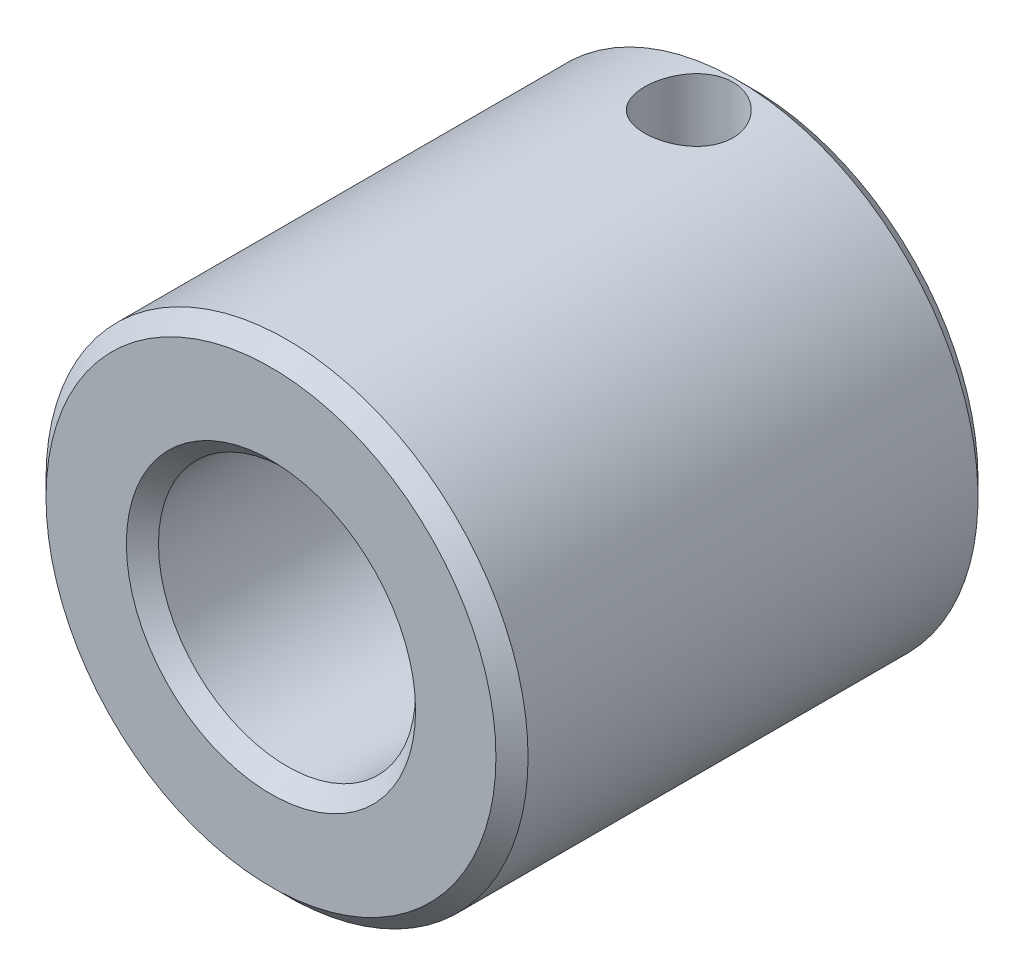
ISO-10303-21;
HEADER;
FILE_DESCRIPTION(('STEP AP214'),'2;1');
FILE_NAME('part.step','',(''),(''),'','','');
FILE_SCHEMA(('AUTOMOTIVE_DESIGN { 1 0 10303 214 1 1 1 1 }'));
ENDSEC;
DATA;
#1=APPLICATION_CONTEXT('core data for automotive mechanical design processes');
#2=APPLICATION_PROTOCOL_DEFINITION('international standard','automotive_design',2000,#1);
#3=PRODUCT_CONTEXT('',#1,'mechanical');
#4=PRODUCT('Part','Part','',(#3));
#5=PRODUCT_RELATED_PRODUCT_CATEGORY('part','',(#4));
#6=PRODUCT_DEFINITION_FORMATION('','',#4);
#7=PRODUCT_DEFINITION_CONTEXT('part definition',#1,'design');
#8=PRODUCT_DEFINITION('design','',#6,#7);
#9=PRODUCT_DEFINITION_SHAPE('','',#8);
#10=(LENGTH_UNIT() NAMED_UNIT(*) SI_UNIT(.MILLI.,.METRE.));
#11=(NAMED_UNIT(*) PLANE_ANGLE_UNIT() SI_UNIT($,.RADIAN.));
#12=(NAMED_UNIT(*) SI_UNIT($,.STERADIAN.) SOLID_ANGLE_UNIT());
#13=UNCERTAINTY_MEASURE_WITH_UNIT(LENGTH_MEASURE(1.E-05),#10,'distance_accuracy_value','');
#14=(GEOMETRIC_REPRESENTATION_CONTEXT(3) GLOBAL_UNCERTAINTY_ASSIGNED_CONTEXT((#13)) GLOBAL_UNIT_ASSIGNED_CONTEXT((#10,
#11,#12)) REPRESENTATION_CONTEXT('',''));
#15=CARTESIAN_POINT('',(0.,0.,0.));
#16=DIRECTION('',(0.,0.,1.));
#17=DIRECTION('',(1.,0.,0.));
#18=AXIS2_PLACEMENT_3D('',#15,#16,#17);
#19=CARTESIAN_POINT('',(0.,15.,4.));
#20=DIRECTION('',(0.,-1.,0.));
#21=DIRECTION('',(0.,0.,-1.));
#22=AXIS2_PLACEMENT_3D('',#19,#20,#21);
#23=CYLINDRICAL_SURFACE('',#22,2.75);
#24=CARTESIAN_POINT('',(0.,8.,6.75));
#25=CARTESIAN_POINT('',(-0.14956672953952,7.99999384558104,6.74999152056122));
#26=CARTESIAN_POINT('',(-0.299284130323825,7.99576025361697,6.73774075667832));
#27=CARTESIAN_POINT('',(-0.594450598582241,7.97925894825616,6.6891587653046));
#28=CARTESIAN_POINT('',(-0.739892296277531,7.96697812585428,6.65278824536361));
#29=CARTESIAN_POINT('',(-1.02197102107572,7.93572094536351,6.55737852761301));
#30=CARTESIAN_POINT('',(-1.15862804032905,7.9167604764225,6.49839309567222));
#31=CARTESIAN_POINT('',(-1.4200571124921,7.87407176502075,6.35962943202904));
#32=CARTESIAN_POINT('',(-1.54483040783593,7.85034402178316,6.27985337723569));
#33=CARTESIAN_POINT('',(-1.78358591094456,7.79962918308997,6.09869301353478));
#34=CARTESIAN_POINT('',(-1.89707439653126,7.77256021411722,5.99668101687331));
#35=CARTESIAN_POINT('',(-2.1057189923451,7.71865165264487,5.77527405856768));
#36=CARTESIAN_POINT('',(-2.2008697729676,7.69181212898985,5.65587406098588));
#37=CARTESIAN_POINT('',(-2.37301190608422,7.64049412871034,5.39856990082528));
#38=CARTESIAN_POINT('',(-2.44935124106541,7.6161142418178,5.26020794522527));
#39=CARTESIAN_POINT('',(-2.57746378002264,7.5737221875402,4.97163675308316));
#40=CARTESIAN_POINT('',(-2.62924512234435,7.55570791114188,4.82143146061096));
#41=CARTESIAN_POINT('',(-2.70490383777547,7.52894839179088,4.51904862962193));
#42=CARTESIAN_POINT('',(-2.7297071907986,7.5198965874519,4.36713073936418));
#43=CARTESIAN_POINT('',(-2.75360105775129,7.5111822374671,4.06104056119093));
#44=CARTESIAN_POINT('',(-2.75270012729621,7.51151656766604,3.90686904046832));
#45=CARTESIAN_POINT('',(-2.72592737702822,7.52126905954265,3.6086771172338));
#46=CARTESIAN_POINT('',(-2.70128140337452,7.53024127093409,3.46452949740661));
#47=CARTESIAN_POINT('',(-2.62972414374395,7.55552619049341,3.18255518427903));
#48=CARTESIAN_POINT('',(-2.58280993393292,7.57183986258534,3.04472932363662));
#49=CARTESIAN_POINT('',(-2.4672762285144,7.61027560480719,2.77659310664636));
#50=CARTESIAN_POINT('',(-2.39830412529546,7.63249096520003,2.6464486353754));
#51=CARTESIAN_POINT('',(-2.24086101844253,7.68018831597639,2.3992076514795));
#52=CARTESIAN_POINT('',(-2.15238510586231,7.70567112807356,2.2821144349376));
#53=CARTESIAN_POINT('',(-1.9526402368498,7.75876536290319,2.05744398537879));
#54=CARTESIAN_POINT('',(-1.84037747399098,7.78641635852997,1.95075786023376));
#55=CARTESIAN_POINT('',(-1.59917370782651,7.83950721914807,1.75744908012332));
#56=CARTESIAN_POINT('',(-1.47022536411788,7.86494610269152,1.67083530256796));
#57=CARTESIAN_POINT('',(-1.19729167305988,7.91112296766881,1.51934595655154));
#58=CARTESIAN_POINT('',(-1.05314663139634,7.93180184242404,1.45473938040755));
#59=CARTESIAN_POINT('',(-0.755303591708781,7.96566677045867,1.35108040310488));
#60=CARTESIAN_POINT('',(-0.601625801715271,7.97886811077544,1.31197584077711));
#61=CARTESIAN_POINT('',(-0.372091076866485,7.99168505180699,1.27426479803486));
#62=CARTESIAN_POINT('',(-0.298011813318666,7.99479349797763,1.26517728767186));
#63=CARTESIAN_POINT('',(-0.149300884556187,7.99895250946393,1.25304276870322));
#64=CARTESIAN_POINT('',(-0.0746692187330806,8.00000307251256,1.24999576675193));
#65=CARTESIAN_POINT('',(0.149566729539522,7.99999384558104,1.25000847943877));
#66=CARTESIAN_POINT('',(0.299284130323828,7.99576025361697,1.26225924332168));
#67=CARTESIAN_POINT('',(0.594450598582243,7.97925894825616,1.3108412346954));
#68=CARTESIAN_POINT('',(0.739892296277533,7.96697812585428,1.3472117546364));
#69=CARTESIAN_POINT('',(1.02197102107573,7.93572094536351,1.442621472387));
#70=CARTESIAN_POINT('',(1.15862804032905,7.9167604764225,1.50160690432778));
#71=CARTESIAN_POINT('',(1.4200571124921,7.87407176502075,1.64037056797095));
#72=CARTESIAN_POINT('',(1.54483040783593,7.85034402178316,1.72014662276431));
#73=CARTESIAN_POINT('',(1.78358591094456,7.79962918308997,1.90130698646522));
#74=CARTESIAN_POINT('',(1.89707439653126,7.77256021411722,2.00331898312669));
#75=CARTESIAN_POINT('',(2.1057189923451,7.71865165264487,2.22472594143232));
#76=CARTESIAN_POINT('',(2.2008697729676,7.69181212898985,2.34412593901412));
#77=CARTESIAN_POINT('',(2.37301190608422,7.64049412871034,2.60143009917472));
#78=CARTESIAN_POINT('',(2.44935124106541,7.6161142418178,2.73979205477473));
#79=CARTESIAN_POINT('',(2.57746378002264,7.5737221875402,3.02836324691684));
#80=CARTESIAN_POINT('',(2.62924512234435,7.55570791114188,3.17856853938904));
#81=CARTESIAN_POINT('',(2.70490383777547,7.52894839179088,3.48095137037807));
#82=CARTESIAN_POINT('',(2.7297071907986,7.5198965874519,3.63286926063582));
#83=CARTESIAN_POINT('',(2.75360105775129,7.5111822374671,3.93895943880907));
#84=CARTESIAN_POINT('',(2.75270012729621,7.51151656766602,4.09313095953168));
#85=CARTESIAN_POINT('',(2.72592737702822,7.52126905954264,4.3913228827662));
#86=CARTESIAN_POINT('',(2.70128140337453,7.53024127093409,4.53547050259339));
#87=CARTESIAN_POINT('',(2.62972414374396,7.55552619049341,4.81744481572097));
#88=CARTESIAN_POINT('',(2.58280993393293,7.57183986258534,4.95527067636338));
#89=CARTESIAN_POINT('',(2.4672762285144,7.61027560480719,5.22340689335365));
#90=CARTESIAN_POINT('',(2.39830412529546,7.63249096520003,5.3535513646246));
#91=CARTESIAN_POINT('',(2.24086101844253,7.68018831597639,5.60079234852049));
#92=CARTESIAN_POINT('',(2.15238510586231,7.70567112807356,5.7178855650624));
#93=CARTESIAN_POINT('',(1.9526402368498,7.75876536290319,5.94255601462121));
#94=CARTESIAN_POINT('',(1.84037747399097,7.78641635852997,6.04924213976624));
#95=CARTESIAN_POINT('',(1.59917370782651,7.83950721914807,6.24255091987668));
#96=CARTESIAN_POINT('',(1.47022536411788,7.86494610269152,6.32916469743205));
#97=CARTESIAN_POINT('',(1.19729167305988,7.91112296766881,6.48065404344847));
#98=CARTESIAN_POINT('',(1.05314663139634,7.93180184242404,6.54526061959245));
#99=CARTESIAN_POINT('',(0.75530359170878,7.96566677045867,6.64891959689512));
#100=CARTESIAN_POINT('',(0.601625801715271,7.97886811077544,6.68802415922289));
#101=CARTESIAN_POINT('',(0.372091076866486,7.99168505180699,6.72573520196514));
#102=CARTESIAN_POINT('',(0.298011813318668,7.99479349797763,6.73482271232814));
#103=CARTESIAN_POINT('',(0.14930088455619,7.99895250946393,6.74695723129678));
#104=CARTESIAN_POINT('',(0.074669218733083,8.00000307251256,6.75000423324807));
#105=CARTESIAN_POINT('',(0.,8.,6.75));
#106=B_SPLINE_CURVE_WITH_KNOTS('',3,(#24,#25,#26,#27,#28,#29,#30,#31,#32,#33,#34,#35,#36,#37,
#38,#39,#40,#41,#42,#43,#44,#45,#46,#47,#48,#49,#50,#51,#52,#53,#54,#55,#56,#57,#58,#59,#60,#61,
#62,#63,#64,#65,#66,#67,#68,#69,#70,#71,#72,#73,#74,#75,#76,#77,#78,#79,#80,#81,#82,#83,#84,#85,
#86,#87,#88,#89,#90,#91,#92,#93,#94,#95,#96,#97,#98,#99,#100,#101,#102,#103,#104,#105),
.UNSPECIFIED.,.T.,.F.,(4,2,2,2,2,2,2,2,2,2,2,2,2,2,2,2,2,2,2,2,2,2,2,2,2,2,2,2,2,2,2,2,2,2,2,2,
2,2,2,2,4),(0.,0.448411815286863,0.897555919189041,1.34563876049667,1.79367470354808,
2.25653673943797,2.71953309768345,3.19683681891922,3.67398225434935,4.13417629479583,
4.5942171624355,5.03171401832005,5.46926833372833,5.9141996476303,6.35924307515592,
6.82903174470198,7.29902779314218,7.77457812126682,8.24915269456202,8.47301613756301,
8.69687982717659,9.14529164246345,9.59443574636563,10.0425185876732,10.4905545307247,
10.9534165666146,11.41641292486,11.8937166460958,12.3708620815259,12.8310561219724,
13.2910969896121,13.7285938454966,14.1661481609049,14.6110794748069,15.0561229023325,
15.5259115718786,15.9959076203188,16.4714579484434,16.9460325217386,17.1698959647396,
17.3937596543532),.UNSPECIFIED.);
#107=CARTESIAN_POINT('',(0.,8.,6.75));
#108=VERTEX_POINT('',#107);
#109=EDGE_CURVE('E45',#108,#108,#106,.T.);
#110=ORIENTED_EDGE('',*,*,#109,.T.);
#111=EDGE_LOOP('',(#110));
#112=FACE_BOUND('',#111,.T.);
#113=CARTESIAN_POINT('',(0.,15.,6.75));
#114=CARTESIAN_POINT('',(-0.152939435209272,14.9999967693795,6.74999281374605));
#115=CARTESIAN_POINT('',(-0.306071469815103,14.997634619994,6.7371870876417));
#116=CARTESIAN_POINT('',(-0.608143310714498,14.9884323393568,6.68629994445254));
#117=CARTESIAN_POINT('',(-0.757074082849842,14.9815832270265,6.64816783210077));
#118=CARTESIAN_POINT('',(-1.04615408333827,14.9641738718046,6.54782757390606));
#119=CARTESIAN_POINT('',(-1.18631467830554,14.9536185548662,6.48565137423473));
#120=CARTESIAN_POINT('',(-1.45415890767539,14.9299538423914,6.33906615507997));
#121=CARTESIAN_POINT('',(-1.58184691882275,14.9168453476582,6.25466497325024));
#122=CARTESIAN_POINT('',(-1.82266162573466,14.889350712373,6.06497899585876));
#123=CARTESIAN_POINT('',(-1.9356233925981,14.8749527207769,5.95948649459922));
#124=CARTESIAN_POINT('',(-2.14235500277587,14.8465898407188,5.73105441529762));
#125=CARTESIAN_POINT('',(-2.23612249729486,14.8326250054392,5.60811270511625));
#126=CARTESIAN_POINT('',(-2.40246884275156,14.8065968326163,5.34713206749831));
#127=CARTESIAN_POINT('',(-2.4748830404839,14.7945485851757,5.2089865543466));
#128=CARTESIAN_POINT('',(-2.59541249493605,14.7738822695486,4.92223450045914));
#129=CARTESIAN_POINT('',(-2.64352995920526,14.7652638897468,4.77362891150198));
#130=CARTESIAN_POINT('',(-2.71357913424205,14.7525507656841,4.47191721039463));
#131=CARTESIAN_POINT('',(-2.73579492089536,14.7484069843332,4.31887915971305));
#132=CARTESIAN_POINT('',(-2.75429165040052,14.7449642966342,4.01119574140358));
#133=CARTESIAN_POINT('',(-2.75057477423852,14.7456649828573,3.85655051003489));
#134=CARTESIAN_POINT('',(-2.71754232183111,14.751787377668,3.55209589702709));
#135=CARTESIAN_POINT('',(-2.68854917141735,14.7571496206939,3.40225016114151));
#136=CARTESIAN_POINT('',(-2.60629417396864,14.7718976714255,3.10958521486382));
#137=CARTESIAN_POINT('',(-2.55303114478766,14.7812836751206,2.96676634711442));
#138=CARTESIAN_POINT('',(-2.42342864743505,14.8030846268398,2.69125826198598));
#139=CARTESIAN_POINT('',(-2.34695749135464,14.815516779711,2.55863241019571));
#140=CARTESIAN_POINT('',(-2.17320882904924,14.8419965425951,2.30798340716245));
#141=CARTESIAN_POINT('',(-2.07593087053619,14.8560441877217,2.18996057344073));
#142=CARTESIAN_POINT('',(-1.86160679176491,14.8844299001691,1.97001308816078));
#143=CARTESIAN_POINT('',(-1.74428821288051,14.8987691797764,1.86835393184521));
#144=CARTESIAN_POINT('',(-1.4940603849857,14.9259369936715,1.68607542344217));
#145=CARTESIAN_POINT('',(-1.36114426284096,14.9387648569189,1.60546539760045));
#146=CARTESIAN_POINT('',(-1.08318739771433,14.9614900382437,1.46754334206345));
#147=CARTESIAN_POINT('',(-0.938123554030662,14.9713816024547,1.41027697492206));
#148=CARTESIAN_POINT('',(-0.640402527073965,14.9870605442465,1.32111261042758));
#149=CARTESIAN_POINT('',(-0.487762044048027,14.9928565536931,1.28916124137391));
#150=CARTESIAN_POINT('',(-0.278324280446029,14.9975209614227,1.26354988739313));
#151=CARTESIAN_POINT('',(-0.222792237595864,14.9984485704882,1.2584728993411));
#152=CARTESIAN_POINT('',(-0.111515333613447,14.999688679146,1.25169664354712));
#153=CARTESIAN_POINT('',(-0.0557704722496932,15.0000011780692,1.24999737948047));
#154=CARTESIAN_POINT('',(0.152939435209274,14.9999967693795,1.25000718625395));
#155=CARTESIAN_POINT('',(0.306071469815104,14.997634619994,1.2628129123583));
#156=CARTESIAN_POINT('',(0.6081433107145,14.9884323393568,1.31370005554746));
#157=CARTESIAN_POINT('',(0.757074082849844,14.9815832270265,1.35183216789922));
#158=CARTESIAN_POINT('',(1.04615408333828,14.9641738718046,1.45217242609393));
#159=CARTESIAN_POINT('',(1.18631467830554,14.9536185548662,1.51434862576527));
#160=CARTESIAN_POINT('',(1.45415890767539,14.9299538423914,1.66093384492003));
#161=CARTESIAN_POINT('',(1.58184691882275,14.9168453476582,1.74533502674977));
#162=CARTESIAN_POINT('',(1.82266162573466,14.889350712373,1.93502100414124));
#163=CARTESIAN_POINT('',(1.9356233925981,14.8749527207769,2.04051350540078));
#164=CARTESIAN_POINT('',(2.14235500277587,14.8465898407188,2.26894558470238));
#165=CARTESIAN_POINT('',(2.23612249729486,14.8326250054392,2.39188729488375));
#166=CARTESIAN_POINT('',(2.40246884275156,14.8065968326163,2.65286793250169));
#167=CARTESIAN_POINT('',(2.4748830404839,14.7945485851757,2.7910134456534));
#168=CARTESIAN_POINT('',(2.59541249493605,14.7738822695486,3.07776549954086));
#169=CARTESIAN_POINT('',(2.64352995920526,14.7652638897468,3.22637108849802));
#170=CARTESIAN_POINT('',(2.71357913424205,14.7525507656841,3.52808278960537));
#171=CARTESIAN_POINT('',(2.73579492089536,14.7484069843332,3.68112084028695));
#172=CARTESIAN_POINT('',(2.75429165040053,14.7449642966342,3.98880425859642));
#173=CARTESIAN_POINT('',(2.75057477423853,14.7456649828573,4.14344948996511));
#174=CARTESIAN_POINT('',(2.71754232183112,14.751787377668,4.44790410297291));
#175=CARTESIAN_POINT('',(2.68854917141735,14.7571496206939,4.59774983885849));
#176=CARTESIAN_POINT('',(2.60629417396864,14.7718976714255,4.89041478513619));
#177=CARTESIAN_POINT('',(2.55303114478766,14.7812836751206,5.03323365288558));
#178=CARTESIAN_POINT('',(2.42342864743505,14.8030846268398,5.30874173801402));
#179=CARTESIAN_POINT('',(2.34695749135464,14.815516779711,5.44136758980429));
#180=CARTESIAN_POINT('',(2.17320882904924,14.8419965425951,5.69201659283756));
#181=CARTESIAN_POINT('',(2.07593087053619,14.8560441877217,5.81003942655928));
#182=CARTESIAN_POINT('',(1.86160679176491,14.8844299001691,6.02998691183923));
#183=CARTESIAN_POINT('',(1.74428821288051,14.8987691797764,6.13164606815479));
#184=CARTESIAN_POINT('',(1.4940603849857,14.9259369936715,6.31392457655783));
#185=CARTESIAN_POINT('',(1.36114426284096,14.9387648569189,6.39453460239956));
#186=CARTESIAN_POINT('',(1.08318739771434,14.9614900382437,6.53245665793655));
#187=CARTESIAN_POINT('',(0.938123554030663,14.9713816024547,6.58972302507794));
#188=CARTESIAN_POINT('',(0.640402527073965,14.9870605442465,6.67888738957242));
#189=CARTESIAN_POINT('',(0.487762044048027,14.9928565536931,6.71083875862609));
#190=CARTESIAN_POINT('',(0.27832428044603,14.9975209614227,6.73645011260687));
#191=CARTESIAN_POINT('',(0.222792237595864,14.9984485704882,6.7415271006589));
#192=CARTESIAN_POINT('',(0.111515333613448,14.999688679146,6.74830335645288));
#193=CARTESIAN_POINT('',(0.055770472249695,15.0000011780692,6.75000262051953));
#194=CARTESIAN_POINT('',(0.,15.,6.75));
#195=B_SPLINE_CURVE_WITH_KNOTS('',3,(#113,#114,#115,#116,#117,#118,#119,#120,#121,#122,#123,
#124,#125,#126,#127,#128,#129,#130,#131,#132,#133,#134,#135,#136,#137,#138,#139,#140,#141,#142,
#143,#144,#145,#146,#147,#148,#149,#150,#151,#152,#153,#154,#155,#156,#157,#158,#159,#160,#161,
#162,#163,#164,#165,#166,#167,#168,#169,#170,#171,#172,#173,#174,#175,#176,#177,#178,#179,#180,
#181,#182,#183,#184,#185,#186,#187,#188,#189,#190,#191,#192,#193,#194),.UNSPECIFIED.,.T.,.F.,(4,
2,2,2,2,2,2,2,2,2,2,2,2,2,2,2,2,2,2,2,2,2,2,2,2,2,2,2,2,2,2,2,2,2,2,2,2,2,2,2,4),(0.,
0.458605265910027,0.918131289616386,1.37704885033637,1.83580478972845,2.2993232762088,
2.76289844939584,3.22995995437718,3.69697901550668,4.15882638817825,4.6206349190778,
5.07663738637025,5.53266206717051,5.99132430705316,6.44999651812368,6.91548961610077,
7.38118861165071,7.84779423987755,8.31341348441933,8.48064703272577,8.64788076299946,
9.10648602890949,9.56601205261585,10.0249296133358,10.4836855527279,10.9472040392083,
11.4107792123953,11.8778407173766,12.3448597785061,12.8067071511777,13.2685156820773,
13.7245181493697,14.18054283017,14.6392050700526,15.0978772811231,15.5633703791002,
16.0290693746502,16.495675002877,16.9612942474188,17.1285277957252,17.2957615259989),.UNSPECIFIED.);
#196=CARTESIAN_POINT('',(0.,15.,6.75));
#197=VERTEX_POINT('',#196);
#198=EDGE_CURVE('E44',#197,#197,#195,.T.);
#199=ORIENTED_EDGE('',*,*,#198,.F.);
#200=EDGE_LOOP('',(#199));
#201=FACE_BOUND('',#200,.T.);
#202=ADVANCED_FACE('F12',(#112,#201),#23,.F.);
#203=CARTESIAN_POINT('',(0.,0.,0.));
#204=DIRECTION('',(0.,0.,-1.));
#205=DIRECTION('',(-1.,0.,0.));
#206=AXIS2_PLACEMENT_3D('',#203,#204,#205);
#207=CYLINDRICAL_SURFACE('',#206,8.);
#208=CARTESIAN_POINT('',(0.,0.,1.));
#209=DIRECTION('',(0.,0.,-1.));
#210=DIRECTION('',(-1.,0.,0.));
#211=AXIS2_PLACEMENT_3D('',#208,#209,#210);
#212=CIRCLE('',#211,8.);
#213=CARTESIAN_POINT('',(-8.,0.,1.));
#214=VERTEX_POINT('',#213);
#215=EDGE_CURVE('E32',#214,#214,#212,.T.);
#216=ORIENTED_EDGE('',*,*,#215,.T.);
#217=EDGE_LOOP('',(#216));
#218=FACE_BOUND('',#217,.T.);
#219=CARTESIAN_POINT('',(0.,0.,29.));
#220=DIRECTION('',(0.,0.,1.));
#221=DIRECTION('',(1.,0.,0.));
#222=AXIS2_PLACEMENT_3D('',#219,#220,#221);
#223=CIRCLE('',#222,8.);
#224=CARTESIAN_POINT('',(8.,0.,29.));
#225=VERTEX_POINT('',#224);
#226=EDGE_CURVE('E35',#225,#225,#223,.T.);
#227=ORIENTED_EDGE('',*,*,#226,.T.);
#228=EDGE_LOOP('',(#227));
#229=FACE_BOUND('',#228,.T.);
#230=ORIENTED_EDGE('',*,*,#109,.F.);
#231=EDGE_LOOP('',(#230));
#232=FACE_BOUND('',#231,.T.);
#233=ADVANCED_FACE('F59',(#218,#229,#232),#207,.F.);
#234=CARTESIAN_POINT('',(0.,15.,30.));
#235=DIRECTION('',(0.,0.,1.));
#236=DIRECTION('',(1.,0.,0.));
#237=AXIS2_PLACEMENT_3D('',#234,#235,#236);
#238=PLANE('',#237);
#239=CARTESIAN_POINT('',(0.,0.,30.));
#240=DIRECTION('',(0.,0.,1.));
#241=DIRECTION('',(1.,0.,0.));
#242=AXIS2_PLACEMENT_3D('',#239,#240,#241);
#243=CIRCLE('',#242,14.);
#244=CARTESIAN_POINT('',(14.,0.,30.));
#245=VERTEX_POINT('',#244);
#246=EDGE_CURVE('E8',#245,#245,#243,.T.);
#247=ORIENTED_EDGE('',*,*,#246,.T.);
#248=EDGE_LOOP('',(#247));
#249=FACE_BOUND('',#248,.T.);
#250=CARTESIAN_POINT('',(0.,0.,30.));
#251=DIRECTION('',(0.,0.,1.));
#252=DIRECTION('',(1.,0.,0.));
#253=AXIS2_PLACEMENT_3D('',#250,#251,#252);
#254=CIRCLE('',#253,9.);
#255=CARTESIAN_POINT('',(9.,0.,30.));
#256=VERTEX_POINT('',#255);
#257=EDGE_CURVE('E19',#256,#256,#254,.F.);
#258=ORIENTED_EDGE('',*,*,#257,.T.);
#259=EDGE_LOOP('',(#258));
#260=FACE_BOUND('',#259,.T.);
#261=ADVANCED_FACE('F63',(#249,#260),#238,.T.);
#262=CARTESIAN_POINT('',(0.,15.,0.));
#263=DIRECTION('',(0.,0.,-1.));
#264=DIRECTION('',(-1.,0.,0.));
#265=AXIS2_PLACEMENT_3D('',#262,#263,#264);
#266=PLANE('',#265);
#267=CARTESIAN_POINT('',(0.,0.,0.));
#268=DIRECTION('',(0.,0.,-1.));
#269=DIRECTION('',(-1.,0.,0.));
#270=AXIS2_PLACEMENT_3D('',#267,#268,#269);
#271=CIRCLE('',#270,9.);
#272=CARTESIAN_POINT('',(-9.,0.,0.));
#273=VERTEX_POINT('',#272);
#274=EDGE_CURVE('E38',#273,#273,#271,.F.);
#275=ORIENTED_EDGE('',*,*,#274,.T.);
#276=EDGE_LOOP('',(#275));
#277=FACE_BOUND('',#276,.T.);
#278=CARTESIAN_POINT('',(0.,0.,0.));
#279=DIRECTION('',(0.,0.,-1.));
#280=DIRECTION('',(-1.,0.,0.));
#281=AXIS2_PLACEMENT_3D('',#278,#279,#280);
#282=CIRCLE('',#281,14.);
#283=CARTESIAN_POINT('',(-14.,0.,0.));
#284=VERTEX_POINT('',#283);
#285=EDGE_CURVE('E41',#284,#284,#282,.T.);
#286=ORIENTED_EDGE('',*,*,#285,.T.);
#287=EDGE_LOOP('',(#286));
#288=FACE_BOUND('',#287,.T.);
#289=ADVANCED_FACE('F67',(#277,#288),#266,.T.);
#290=CARTESIAN_POINT('',(0.,0.,0.));
#291=DIRECTION('',(0.,0.,-1.));
#292=DIRECTION('',(-1.,0.,0.));
#293=AXIS2_PLACEMENT_3D('',#290,#291,#292);
#294=CYLINDRICAL_SURFACE('',#293,15.);
#295=CARTESIAN_POINT('',(0.,0.,1.));
#296=DIRECTION('',(0.,0.,-1.));
#297=DIRECTION('',(-1.,0.,0.));
#298=AXIS2_PLACEMENT_3D('',#295,#296,#297);
#299=CIRCLE('',#298,15.);
#300=CARTESIAN_POINT('',(-15.,0.,1.));
#301=VERTEX_POINT('',#300);
#302=EDGE_CURVE('E23',#301,#301,#299,.F.);
#303=ORIENTED_EDGE('',*,*,#302,.T.);
#304=EDGE_LOOP('',(#303));
#305=FACE_BOUND('',#304,.T.);
#306=CARTESIAN_POINT('',(0.,0.,29.));
#307=DIRECTION('',(0.,0.,1.));
#308=DIRECTION('',(1.,0.,0.));
#309=AXIS2_PLACEMENT_3D('',#306,#307,#308);
#310=CIRCLE('',#309,15.);
#311=CARTESIAN_POINT('',(15.,0.,29.));
#312=VERTEX_POINT('',#311);
#313=EDGE_CURVE('E27',#312,#312,#310,.F.);
#314=ORIENTED_EDGE('',*,*,#313,.T.);
#315=EDGE_LOOP('',(#314));
#316=FACE_BOUND('',#315,.T.);
#317=ORIENTED_EDGE('',*,*,#198,.T.);
#318=EDGE_LOOP('',(#317));
#319=FACE_BOUND('',#318,.T.);
#320=ADVANCED_FACE('F69',(#305,#316,#319),#294,.T.);
#321=CARTESIAN_POINT('',(0.,0.,0.));
#322=DIRECTION('',(0.,0.,-1.));
#323=DIRECTION('',(-1.,0.,0.));
#324=AXIS2_PLACEMENT_3D('',#321,#322,#323);
#325=CONICAL_SURFACE('',#324,9.,0.785398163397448);
#326=ORIENTED_EDGE('',*,*,#215,.F.);
#327=EDGE_LOOP('',(#326));
#328=FACE_BOUND('',#327,.T.);
#329=ORIENTED_EDGE('',*,*,#274,.F.);
#330=EDGE_LOOP('',(#329));
#331=FACE_BOUND('',#330,.T.);
#332=ADVANCED_FACE('F73',(#328,#331),#325,.F.);
#333=CARTESIAN_POINT('',(0.,0.,1.));
#334=DIRECTION('',(0.,0.,1.));
#335=DIRECTION('',(1.,0.,0.));
#336=AXIS2_PLACEMENT_3D('',#333,#334,#335);
#337=CONICAL_SURFACE('',#336,15.,0.785398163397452);
#338=ORIENTED_EDGE('',*,*,#285,.F.);
#339=EDGE_LOOP('',(#338));
#340=FACE_BOUND('',#339,.T.);
#341=ORIENTED_EDGE('',*,*,#302,.F.);
#342=EDGE_LOOP('',(#341));
#343=FACE_BOUND('',#342,.T.);
#344=ADVANCED_FACE('F80',(#340,#343),#337,.T.);
#345=CARTESIAN_POINT('',(0.,0.,29.));
#346=DIRECTION('',(0.,0.,-1.));
#347=DIRECTION('',(-1.,0.,0.));
#348=AXIS2_PLACEMENT_3D('',#345,#346,#347);
#349=CONICAL_SURFACE('',#348,15.,0.785398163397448);
#350=ORIENTED_EDGE('',*,*,#246,.F.);
#351=EDGE_LOOP('',(#350));
#352=FACE_BOUND('',#351,.T.);
#353=ORIENTED_EDGE('',*,*,#313,.F.);
#354=EDGE_LOOP('',(#353));
#355=FACE_BOUND('',#354,.T.);
#356=ADVANCED_FACE('F135',(#352,#355),#349,.T.);
#357=CARTESIAN_POINT('',(0.,0.,30.));
#358=DIRECTION('',(0.,0.,1.));
#359=DIRECTION('',(1.,0.,0.));
#360=AXIS2_PLACEMENT_3D('',#357,#358,#359);
#361=CONICAL_SURFACE('',#360,9.,0.785398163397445);
#362=ORIENTED_EDGE('',*,*,#226,.F.);
#363=EDGE_LOOP('',(#362));
#364=FACE_BOUND('',#363,.T.);
#365=ORIENTED_EDGE('',*,*,#257,.F.);
#366=EDGE_LOOP('',(#365));
#367=FACE_BOUND('',#366,.T.);
#368=ADVANCED_FACE('F14',(#364,#367),#361,.F.);
#369=CLOSED_SHELL('',(#202,#233,#261,#289,#320,#332,#344,#356,#368));
#370=MANIFOLD_SOLID_BREP('B1',#369);
#371=ADVANCED_BREP_SHAPE_REPRESENTATION('',(#18,#370),#14);
#372=SHAPE_DEFINITION_REPRESENTATION(#9,#371);
ENDSEC;
END-ISO-10303-21;
